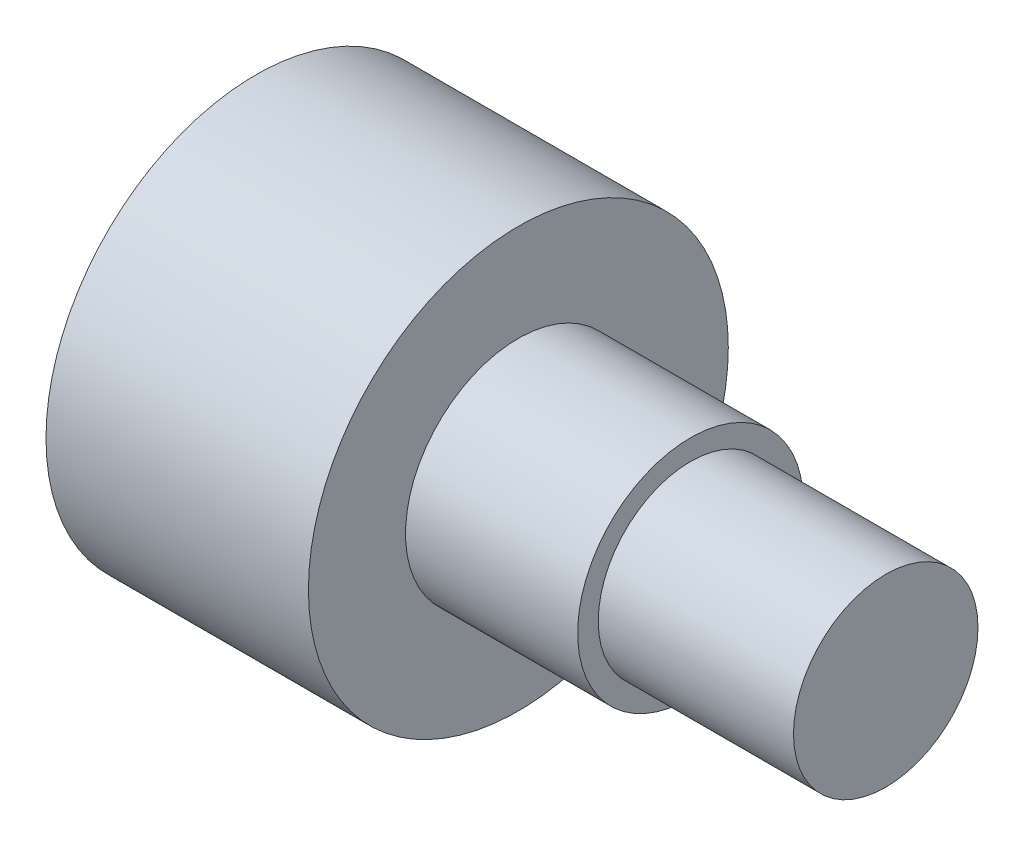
ISO-10303-21;
HEADER;
FILE_DESCRIPTION(('STEP AP214'),'2;1');
FILE_NAME('part.step','',(''),(''),'','','');
FILE_SCHEMA(('AUTOMOTIVE_DESIGN { 1 0 10303 214 1 1 1 1 }'));
ENDSEC;
DATA;
#1=APPLICATION_CONTEXT('core data for automotive mechanical design processes');
#2=APPLICATION_PROTOCOL_DEFINITION('international standard','automotive_design',2000,#1);
#3=PRODUCT_CONTEXT('',#1,'mechanical');
#4=PRODUCT('Part','Part','',(#3));
#5=PRODUCT_RELATED_PRODUCT_CATEGORY('part','',(#4));
#6=PRODUCT_DEFINITION_FORMATION('','',#4);
#7=PRODUCT_DEFINITION_CONTEXT('part definition',#1,'design');
#8=PRODUCT_DEFINITION('design','',#6,#7);
#9=PRODUCT_DEFINITION_SHAPE('','',#8);
#10=(LENGTH_UNIT() NAMED_UNIT(*) SI_UNIT(.MILLI.,.METRE.));
#11=(NAMED_UNIT(*) PLANE_ANGLE_UNIT() SI_UNIT($,.RADIAN.));
#12=(NAMED_UNIT(*) SI_UNIT($,.STERADIAN.) SOLID_ANGLE_UNIT());
#13=UNCERTAINTY_MEASURE_WITH_UNIT(LENGTH_MEASURE(1.E-05),#10,'distance_accuracy_value','');
#14=(GEOMETRIC_REPRESENTATION_CONTEXT(3) GLOBAL_UNCERTAINTY_ASSIGNED_CONTEXT((#13)) GLOBAL_UNIT_ASSIGNED_CONTEXT((#10,
#11,#12)) REPRESENTATION_CONTEXT('',''));
#15=CARTESIAN_POINT('',(0.,0.,0.));
#16=DIRECTION('',(0.,0.,1.));
#17=DIRECTION('',(1.,0.,0.));
#18=AXIS2_PLACEMENT_3D('',#15,#16,#17);
#19=CARTESIAN_POINT('',(0.,0.,0.));
#20=DIRECTION('',(1.,0.,0.));
#21=DIRECTION('',(0.,0.,-1.));
#22=AXIS2_PLACEMENT_3D('',#19,#20,#21);
#23=CYLINDRICAL_SURFACE('',#22,10.75);
#24=CARTESIAN_POINT('',(25.,0.,0.));
#25=DIRECTION('',(1.,0.,0.));
#26=DIRECTION('',(0.,0.,-1.));
#27=AXIS2_PLACEMENT_3D('',#24,#25,#26);
#28=CIRCLE('',#27,10.75);
#29=CARTESIAN_POINT('',(25.,0.,-10.75));
#30=VERTEX_POINT('',#29);
#31=EDGE_CURVE('E38',#30,#30,#28,.T.);
#32=ORIENTED_EDGE('',*,*,#31,.T.);
#33=EDGE_LOOP('',(#32));
#34=FACE_BOUND('',#33,.T.);
#35=CARTESIAN_POINT('',(41.3981358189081,0.,0.));
#36=DIRECTION('',(1.,0.,0.));
#37=DIRECTION('',(0.,0.,-1.));
#38=AXIS2_PLACEMENT_3D('',#35,#36,#37);
#39=CIRCLE('',#38,10.75);
#40=CARTESIAN_POINT('',(41.3981358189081,0.,-10.75));
#41=VERTEX_POINT('',#40);
#42=EDGE_CURVE('E29',#41,#41,#39,.F.);
#43=ORIENTED_EDGE('',*,*,#42,.T.);
#44=EDGE_LOOP('',(#43));
#45=FACE_BOUND('',#44,.T.);
#46=ADVANCED_FACE('F25',(#34,#45),#23,.T.);
#47=CARTESIAN_POINT('',(0.,0.,0.));
#48=DIRECTION('',(-1.,0.,0.));
#49=DIRECTION('',(0.,0.,1.));
#50=AXIS2_PLACEMENT_3D('',#47,#48,#49);
#51=PLANE('',#50);
#52=CARTESIAN_POINT('',(0.,0.,0.));
#53=DIRECTION('',(1.,0.,0.));
#54=DIRECTION('',(0.,0.,-1.));
#55=AXIS2_PLACEMENT_3D('',#52,#53,#54);
#56=CIRCLE('',#55,20.);
#57=CARTESIAN_POINT('',(0.,0.,-20.));
#58=VERTEX_POINT('',#57);
#59=EDGE_CURVE('E10',#58,#58,#56,.T.);
#60=ORIENTED_EDGE('',*,*,#59,.F.);
#61=EDGE_LOOP('',(#60));
#62=FACE_BOUND('',#61,.T.);
#63=ADVANCED_FACE('F27',(#62),#51,.T.);
#64=CARTESIAN_POINT('',(0.,0.,0.));
#65=DIRECTION('',(1.,0.,0.));
#66=DIRECTION('',(0.,0.,-1.));
#67=AXIS2_PLACEMENT_3D('',#64,#65,#66);
#68=CYLINDRICAL_SURFACE('',#67,20.);
#69=ORIENTED_EDGE('',*,*,#59,.T.);
#70=EDGE_LOOP('',(#69));
#71=FACE_BOUND('',#70,.T.);
#72=CARTESIAN_POINT('',(25.,0.,0.));
#73=DIRECTION('',(1.,0.,0.));
#74=DIRECTION('',(0.,0.,-1.));
#75=AXIS2_PLACEMENT_3D('',#72,#73,#74);
#76=CIRCLE('',#75,20.);
#77=CARTESIAN_POINT('',(25.,0.,-20.));
#78=VERTEX_POINT('',#77);
#79=EDGE_CURVE('E33',#78,#78,#76,.T.);
#80=ORIENTED_EDGE('',*,*,#79,.F.);
#81=EDGE_LOOP('',(#80));
#82=FACE_BOUND('',#81,.T.);
#83=ADVANCED_FACE('F59',(#71,#82),#68,.T.);
#84=CARTESIAN_POINT('',(25.,20.,0.));
#85=DIRECTION('',(1.,0.,0.));
#86=DIRECTION('',(0.,0.,-1.));
#87=AXIS2_PLACEMENT_3D('',#84,#85,#86);
#88=PLANE('',#87);
#89=ORIENTED_EDGE('',*,*,#79,.T.);
#90=EDGE_LOOP('',(#89));
#91=FACE_BOUND('',#90,.T.);
#92=ORIENTED_EDGE('',*,*,#31,.F.);
#93=EDGE_LOOP('',(#92));
#94=FACE_BOUND('',#93,.T.);
#95=ADVANCED_FACE('F56',(#91,#94),#88,.T.);
#96=CARTESIAN_POINT('',(41.3981358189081,41.8109187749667,0.));
#97=DIRECTION('',(1.,0.,0.));
#98=DIRECTION('',(0.,0.,-1.));
#99=AXIS2_PLACEMENT_3D('',#96,#97,#98);
#100=PLANE('',#99);
#101=ORIENTED_EDGE('',*,*,#42,.F.);
#102=EDGE_LOOP('',(#101));
#103=FACE_BOUND('',#102,.T.);
#104=CARTESIAN_POINT('',(41.3981358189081,0.,0.));
#105=DIRECTION('',(-1.,0.,0.));
#106=DIRECTION('',(0.,0.,1.));
#107=AXIS2_PLACEMENT_3D('',#104,#105,#106);
#108=CIRCLE('',#107,8.78828229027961);
#109=CARTESIAN_POINT('',(41.3981358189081,0.,8.78828229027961));
#110=VERTEX_POINT('',#109);
#111=EDGE_CURVE('E43',#110,#110,#108,.T.);
#112=ORIENTED_EDGE('',*,*,#111,.T.);
#113=EDGE_LOOP('',(#112));
#114=FACE_BOUND('',#113,.T.);
#115=ADVANCED_FACE('F58',(#103,#114),#100,.T.);
#116=CARTESIAN_POINT('',(60.,0.,0.));
#117=DIRECTION('',(-1.,0.,0.));
#118=DIRECTION('',(0.,0.,1.));
#119=AXIS2_PLACEMENT_3D('',#116,#117,#118);
#120=CYLINDRICAL_SURFACE('',#119,8.78828229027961);
#121=CARTESIAN_POINT('',(60.,0.,0.));
#122=DIRECTION('',(1.,0.,0.));
#123=DIRECTION('',(0.,0.,-1.));
#124=AXIS2_PLACEMENT_3D('',#121,#122,#123);
#125=CIRCLE('',#124,8.78828229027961);
#126=CARTESIAN_POINT('',(60.,0.,-8.78828229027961));
#127=VERTEX_POINT('',#126);
#128=EDGE_CURVE('E41',#127,#127,#125,.T.);
#129=ORIENTED_EDGE('',*,*,#128,.F.);
#130=EDGE_LOOP('',(#129));
#131=FACE_BOUND('',#130,.T.);
#132=ORIENTED_EDGE('',*,*,#111,.F.);
#133=EDGE_LOOP('',(#132));
#134=FACE_BOUND('',#133,.T.);
#135=ADVANCED_FACE('F67',(#131,#134),#120,.T.);
#136=CARTESIAN_POINT('',(60.,10.75,0.));
#137=DIRECTION('',(1.,0.,0.));
#138=DIRECTION('',(0.,0.,-1.));
#139=AXIS2_PLACEMENT_3D('',#136,#137,#138);
#140=PLANE('',#139);
#141=ORIENTED_EDGE('',*,*,#128,.T.);
#142=EDGE_LOOP('',(#141));
#143=FACE_BOUND('',#142,.T.);
#144=ADVANCED_FACE('F76',(#143),#140,.T.);
#145=CLOSED_SHELL('',(#46,#63,#83,#95,#115,#135,#144));
#146=MANIFOLD_SOLID_BREP('B2',#145);
#147=ADVANCED_BREP_SHAPE_REPRESENTATION('',(#18,#146),#14);
#148=SHAPE_DEFINITION_REPRESENTATION(#9,#147);
ENDSEC;
END-ISO-10303-21;
